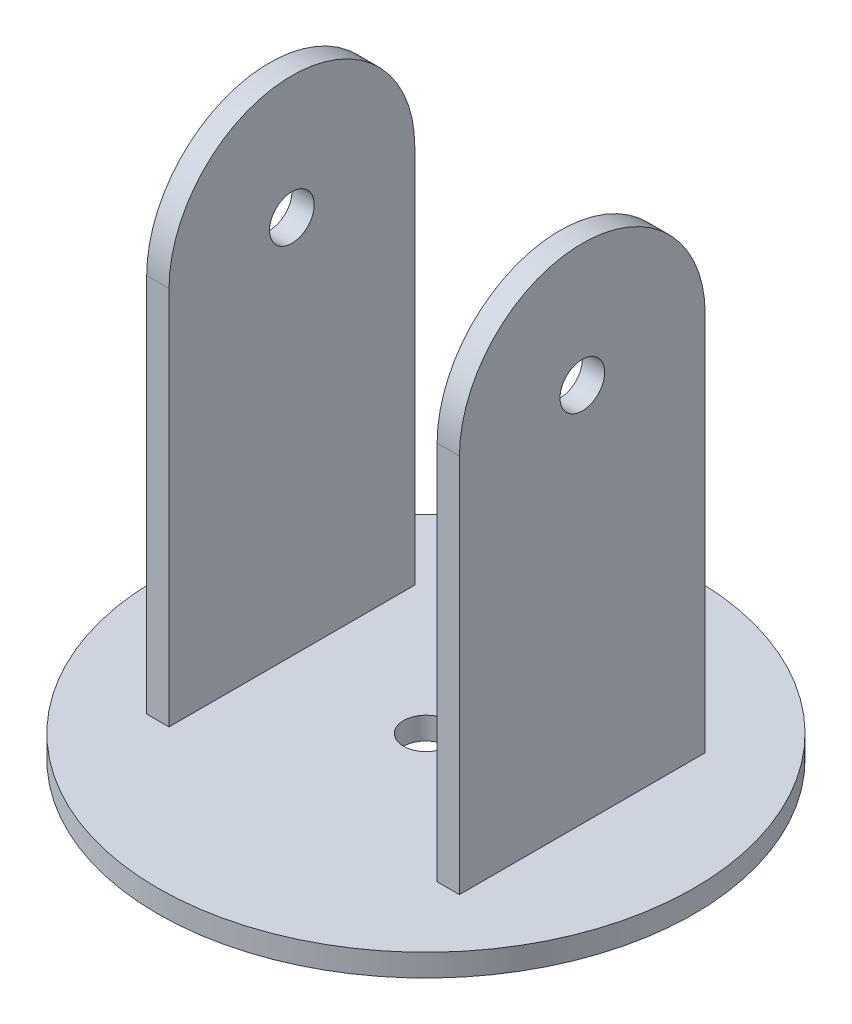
from build123d import *

# Parameters (mm, degrees)
SKETCH2_R           = 60
BOSS_EXTRUDE2_DEPTH = 5
BOSS_EXTRUDE3_DEPTH = 5
SKETCH4_R           = 5
CUT_EXTRUDE1_DEPTH  = 163.576904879
SKETCH5_R           = 5
CUT_EXTRUDE2_DEPTH  = 5


with BuildPart() as part:
    # Sketch2 → Boss-Extrude2 (new body)
    with BuildSketch(Plane(origin=(0, 0, 0), x_dir=(1, 0, 0), z_dir=(0, 1, 0))):
        with Locations(Location((0, 0, 0), (0, 0, 270))):
            Circle(SKETCH2_R)
    extrude(amount=BOSS_EXTRUDE2_DEPTH)

    # Sketch3 → Boss-Extrude3 (add)
    with BuildSketch(Plane(origin=(35, 0, 0), x_dir=(0, 0, -1), z_dir=(1, 0, 0))):
        with BuildLine():
            Line((-27.5, 0), (27.5, 0))
            Line((27.5, 0), (27.5, 90))
            ThreePointArc((27.5, 90), (0, 117.5), (-27.5, 90))
            Line((-27.5, 90), (-27.5, 0))
        make_face()
    boss_extrude3 = extrude(amount=-BOSS_EXTRUDE3_DEPTH)

    # Mirror1: Boss-Extrude3 across plane
    add(boss_extrude3.mirror(Plane(origin=(0, 0, 0), x_dir=(0, 0, 1), z_dir=(1, 0, 0))))

    # Sketch4 → Cut-Extrude1 (cut, through all)
    with BuildSketch(Plane(origin=(35, 0, 0), x_dir=(0, 0, -1), z_dir=(1, 0, 0))):
        with Locations((0, 90)):
            Circle(SKETCH4_R)
    extrude(amount=-CUT_EXTRUDE1_DEPTH, mode=Mode.SUBTRACT)

    # Sketch5 → Cut-Extrude2 (cut)
    with BuildSketch(Plane(origin=(0, 5, 0), x_dir=(1, 0, 0), z_dir=(0, 1, 0))):
        with Locations(Location((0, 0, 0), (0, 0, 270))):
            Circle(SKETCH5_R)
    extrude(amount=-CUT_EXTRUDE2_DEPTH, mode=Mode.SUBTRACT)


solid = part.part
